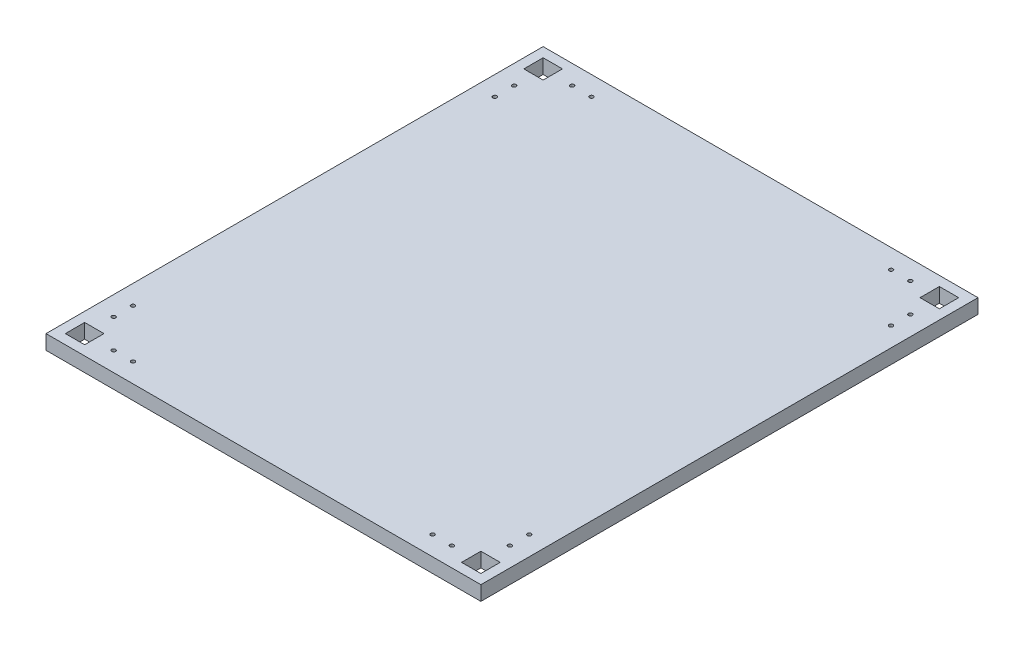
ISO-10303-21;
HEADER;
FILE_DESCRIPTION(('STEP AP214'),'2;1');
FILE_NAME('part.step','',(''),(''),'','','');
FILE_SCHEMA(('AUTOMOTIVE_DESIGN { 1 0 10303 214 1 1 1 1 }'));
ENDSEC;
DATA;
#1=APPLICATION_CONTEXT('core data for automotive mechanical design processes');
#2=APPLICATION_PROTOCOL_DEFINITION('international standard','automotive_design',2000,#1);
#3=PRODUCT_CONTEXT('',#1,'mechanical');
#4=PRODUCT('Part','Part','',(#3));
#5=PRODUCT_RELATED_PRODUCT_CATEGORY('part','',(#4));
#6=PRODUCT_DEFINITION_FORMATION('','',#4);
#7=PRODUCT_DEFINITION_CONTEXT('part definition',#1,'design');
#8=PRODUCT_DEFINITION('design','',#6,#7);
#9=PRODUCT_DEFINITION_SHAPE('','',#8);
#10=(LENGTH_UNIT() NAMED_UNIT(*) SI_UNIT(.MILLI.,.METRE.));
#11=(NAMED_UNIT(*) PLANE_ANGLE_UNIT() SI_UNIT($,.RADIAN.));
#12=(NAMED_UNIT(*) SI_UNIT($,.STERADIAN.) SOLID_ANGLE_UNIT());
#13=UNCERTAINTY_MEASURE_WITH_UNIT(LENGTH_MEASURE(1.E-05),#10,'distance_accuracy_value','');
#14=(GEOMETRIC_REPRESENTATION_CONTEXT(3) GLOBAL_UNCERTAINTY_ASSIGNED_CONTEXT((#13)) GLOBAL_UNIT_ASSIGNED_CONTEXT((#10,
#11,#12)) REPRESENTATION_CONTEXT('',''));
#15=CARTESIAN_POINT('',(0.,0.,0.));
#16=DIRECTION('',(0.,0.,1.));
#17=DIRECTION('',(1.,0.,0.));
#18=AXIS2_PLACEMENT_3D('',#15,#16,#17);
#19=CARTESIAN_POINT('',(225.,15.,257.2));
#20=DIRECTION('',(-1.,0.,0.));
#21=DIRECTION('',(0.,0.,1.));
#22=AXIS2_PLACEMENT_3D('',#19,#20,#21);
#23=PLANE('',#22);
#24=DIRECTION('',(0.,0.,-1.));
#25=VECTOR('',#24,1.);
#26=CARTESIAN_POINT('',(225.,0.,257.2));
#27=LINE('',#26,#25);
#28=CARTESIAN_POINT('',(225.,0.,257.2));
#29=VERTEX_POINT('',#28);
#30=CARTESIAN_POINT('',(225.,0.,-257.2));
#31=VERTEX_POINT('',#30);
#32=EDGE_CURVE('E299',#29,#31,#27,.T.);
#33=ORIENTED_EDGE('',*,*,#32,.T.);
#34=DIRECTION('',(0.,-1.,0.));
#35=VECTOR('',#34,1.);
#36=CARTESIAN_POINT('',(225.,15.,-257.2));
#37=LINE('',#36,#35);
#38=CARTESIAN_POINT('',(225.,15.,-257.2));
#39=VERTEX_POINT('',#38);
#40=EDGE_CURVE('E11',#39,#31,#37,.T.);
#41=ORIENTED_EDGE('',*,*,#40,.F.);
#42=DIRECTION('',(0.,0.,-1.));
#43=VECTOR('',#42,1.);
#44=CARTESIAN_POINT('',(225.,15.,257.2));
#45=LINE('',#44,#43);
#46=CARTESIAN_POINT('',(225.,15.,257.2));
#47=VERTEX_POINT('',#46);
#48=EDGE_CURVE('E306',#47,#39,#45,.T.);
#49=ORIENTED_EDGE('',*,*,#48,.F.);
#50=DIRECTION('',(0.,-1.,0.));
#51=VECTOR('',#50,1.);
#52=CARTESIAN_POINT('',(225.,15.,257.2));
#53=LINE('',#52,#51);
#54=EDGE_CURVE('E316',#47,#29,#53,.T.);
#55=ORIENTED_EDGE('',*,*,#54,.T.);
#56=EDGE_LOOP('',(#33,#41,#49,#55));
#57=FACE_BOUND('',#56,.T.);
#58=ADVANCED_FACE('F37',(#57),#23,.F.);
#59=CARTESIAN_POINT('',(-225.,15.,-257.2));
#60=DIRECTION('',(0.,0.,1.));
#61=DIRECTION('',(1.,0.,0.));
#62=AXIS2_PLACEMENT_3D('',#59,#60,#61);
#63=PLANE('',#62);
#64=DIRECTION('',(-1.,0.,0.));
#65=VECTOR('',#64,1.);
#66=CARTESIAN_POINT('',(-225.,0.,-257.2));
#67=LINE('',#66,#65);
#68=CARTESIAN_POINT('',(-225.,0.,-257.2));
#69=VERTEX_POINT('',#68);
#70=EDGE_CURVE('E319',#31,#69,#67,.T.);
#71=ORIENTED_EDGE('',*,*,#70,.T.);
#72=DIRECTION('',(0.,-1.,0.));
#73=VECTOR('',#72,1.);
#74=CARTESIAN_POINT('',(-225.,15.,-257.2));
#75=LINE('',#74,#73);
#76=CARTESIAN_POINT('',(-225.,15.,-257.2));
#77=VERTEX_POINT('',#76);
#78=EDGE_CURVE('E44',#77,#69,#75,.T.);
#79=ORIENTED_EDGE('',*,*,#78,.F.);
#80=DIRECTION('',(-1.,0.,0.));
#81=VECTOR('',#80,1.);
#82=CARTESIAN_POINT('',(-225.,15.,-257.2));
#83=LINE('',#82,#81);
#84=EDGE_CURVE('E309',#39,#77,#83,.T.);
#85=ORIENTED_EDGE('',*,*,#84,.F.);
#86=ORIENTED_EDGE('',*,*,#40,.T.);
#87=EDGE_LOOP('',(#71,#79,#85,#86));
#88=FACE_BOUND('',#87,.T.);
#89=ADVANCED_FACE('F348',(#88),#63,.F.);
#90=CARTESIAN_POINT('',(-225.,15.,257.2));
#91=DIRECTION('',(1.,0.,0.));
#92=DIRECTION('',(0.,0.,-1.));
#93=AXIS2_PLACEMENT_3D('',#90,#91,#92);
#94=PLANE('',#93);
#95=DIRECTION('',(0.,0.,1.));
#96=VECTOR('',#95,1.);
#97=CARTESIAN_POINT('',(-225.,0.,257.2));
#98=LINE('',#97,#96);
#99=CARTESIAN_POINT('',(-225.,0.,257.2));
#100=VERTEX_POINT('',#99);
#101=EDGE_CURVE('E321',#69,#100,#98,.T.);
#102=ORIENTED_EDGE('',*,*,#101,.T.);
#103=DIRECTION('',(0.,-1.,0.));
#104=VECTOR('',#103,1.);
#105=CARTESIAN_POINT('',(-225.,15.,257.2));
#106=LINE('',#105,#104);
#107=CARTESIAN_POINT('',(-225.,15.,257.2));
#108=VERTEX_POINT('',#107);
#109=EDGE_CURVE('E326',#108,#100,#106,.T.);
#110=ORIENTED_EDGE('',*,*,#109,.F.);
#111=DIRECTION('',(0.,0.,1.));
#112=VECTOR('',#111,1.);
#113=CARTESIAN_POINT('',(-225.,15.,257.2));
#114=LINE('',#113,#112);
#115=EDGE_CURVE('E312',#77,#108,#114,.T.);
#116=ORIENTED_EDGE('',*,*,#115,.F.);
#117=ORIENTED_EDGE('',*,*,#78,.T.);
#118=EDGE_LOOP('',(#102,#110,#116,#117));
#119=FACE_BOUND('',#118,.T.);
#120=ADVANCED_FACE('F333',(#119),#94,.F.);
#121=CARTESIAN_POINT('',(-225.,15.,257.2));
#122=DIRECTION('',(0.,0.,-1.));
#123=DIRECTION('',(-1.,0.,0.));
#124=AXIS2_PLACEMENT_3D('',#121,#122,#123);
#125=PLANE('',#124);
#126=DIRECTION('',(1.,0.,0.));
#127=VECTOR('',#126,1.);
#128=CARTESIAN_POINT('',(-225.,0.,257.2));
#129=LINE('',#128,#127);
#130=EDGE_CURVE('E310',#100,#29,#129,.T.);
#131=ORIENTED_EDGE('',*,*,#130,.T.);
#132=ORIENTED_EDGE('',*,*,#54,.F.);
#133=DIRECTION('',(1.,0.,0.));
#134=VECTOR('',#133,1.);
#135=CARTESIAN_POINT('',(-225.,15.,257.2));
#136=LINE('',#135,#134);
#137=EDGE_CURVE('E314',#108,#47,#136,.T.);
#138=ORIENTED_EDGE('',*,*,#137,.F.);
#139=ORIENTED_EDGE('',*,*,#109,.T.);
#140=EDGE_LOOP('',(#131,#132,#138,#139));
#141=FACE_BOUND('',#140,.T.);
#142=ADVANCED_FACE('F342',(#141),#125,.F.);
#143=CARTESIAN_POINT('',(0.,15.,0.));
#144=DIRECTION('',(0.,-1.,0.));
#145=DIRECTION('',(0.,0.,-1.));
#146=AXIS2_PLACEMENT_3D('',#143,#144,#145);
#147=PLANE('',#146);
#148=CARTESIAN_POINT('',(205.,15.,-207.2));
#149=DIRECTION('',(0.,1.,0.));
#150=DIRECTION('',(0.,0.,-1.));
#151=AXIS2_PLACEMENT_3D('',#148,#149,#150);
#152=CIRCLE('',#151,2.);
#153=CARTESIAN_POINT('',(205.,15.,-209.2));
#154=VERTEX_POINT('',#153);
#155=EDGE_CURVE('E547',#154,#154,#152,.T.);
#156=ORIENTED_EDGE('',*,*,#155,.F.);
#157=EDGE_LOOP('',(#156));
#158=FACE_BOUND('',#157,.T.);
#159=CARTESIAN_POINT('',(155.,15.,-237.2));
#160=DIRECTION('',(0.,1.,0.));
#161=DIRECTION('',(0.,0.,-1.));
#162=AXIS2_PLACEMENT_3D('',#159,#160,#161);
#163=CIRCLE('',#162,2.);
#164=CARTESIAN_POINT('',(155.,15.,-239.2));
#165=VERTEX_POINT('',#164);
#166=EDGE_CURVE('E554',#165,#165,#163,.T.);
#167=ORIENTED_EDGE('',*,*,#166,.F.);
#168=EDGE_LOOP('',(#167));
#169=FACE_BOUND('',#168,.T.);
#170=CARTESIAN_POINT('',(175.,15.,-237.2));
#171=DIRECTION('',(0.,1.,0.));
#172=DIRECTION('',(0.,0.,-1.));
#173=AXIS2_PLACEMENT_3D('',#170,#171,#172);
#174=CIRCLE('',#173,2.);
#175=CARTESIAN_POINT('',(175.,15.,-239.2));
#176=VERTEX_POINT('',#175);
#177=EDGE_CURVE('E535',#176,#176,#174,.T.);
#178=ORIENTED_EDGE('',*,*,#177,.F.);
#179=EDGE_LOOP('',(#178));
#180=FACE_BOUND('',#179,.T.);
#181=CARTESIAN_POINT('',(175.,15.,237.2));
#182=DIRECTION('',(0.,1.,0.));
#183=DIRECTION('',(0.,0.,1.));
#184=AXIS2_PLACEMENT_3D('',#181,#182,#183);
#185=CIRCLE('',#184,2.);
#186=CARTESIAN_POINT('',(175.,15.,239.2));
#187=VERTEX_POINT('',#186);
#188=EDGE_CURVE('E542',#187,#187,#185,.T.);
#189=ORIENTED_EDGE('',*,*,#188,.F.);
#190=EDGE_LOOP('',(#189));
#191=FACE_BOUND('',#190,.T.);
#192=CARTESIAN_POINT('',(205.,15.,-187.2));
#193=DIRECTION('',(0.,1.,0.));
#194=DIRECTION('',(0.,0.,-1.));
#195=AXIS2_PLACEMENT_3D('',#192,#193,#194);
#196=CIRCLE('',#195,2.);
#197=CARTESIAN_POINT('',(205.,15.,-189.2));
#198=VERTEX_POINT('',#197);
#199=EDGE_CURVE('E578',#198,#198,#196,.T.);
#200=ORIENTED_EDGE('',*,*,#199,.F.);
#201=EDGE_LOOP('',(#200));
#202=FACE_BOUND('',#201,.T.);
#203=CARTESIAN_POINT('',(-205.,15.,-187.2));
#204=DIRECTION('',(0.,1.,0.));
#205=DIRECTION('',(0.,0.,1.));
#206=AXIS2_PLACEMENT_3D('',#203,#204,#205);
#207=CIRCLE('',#206,2.);
#208=CARTESIAN_POINT('',(-205.,15.,-185.2));
#209=VERTEX_POINT('',#208);
#210=EDGE_CURVE('E572',#209,#209,#207,.T.);
#211=ORIENTED_EDGE('',*,*,#210,.F.);
#212=EDGE_LOOP('',(#211));
#213=FACE_BOUND('',#212,.T.);
#214=CARTESIAN_POINT('',(-205.,15.,-207.2));
#215=DIRECTION('',(0.,1.,0.));
#216=DIRECTION('',(0.,0.,1.));
#217=AXIS2_PLACEMENT_3D('',#214,#215,#216);
#218=CIRCLE('',#217,2.);
#219=CARTESIAN_POINT('',(-205.,15.,-205.2));
#220=VERTEX_POINT('',#219);
#221=EDGE_CURVE('E566',#220,#220,#218,.T.);
#222=ORIENTED_EDGE('',*,*,#221,.F.);
#223=EDGE_LOOP('',(#222));
#224=FACE_BOUND('',#223,.T.);
#225=CARTESIAN_POINT('',(-155.,15.,-237.2));
#226=DIRECTION('',(0.,1.,0.));
#227=DIRECTION('',(0.,0.,1.));
#228=AXIS2_PLACEMENT_3D('',#225,#226,#227);
#229=CIRCLE('',#228,2.);
#230=CARTESIAN_POINT('',(-155.,15.,-235.2));
#231=VERTEX_POINT('',#230);
#232=EDGE_CURVE('E559',#231,#231,#229,.T.);
#233=ORIENTED_EDGE('',*,*,#232,.F.);
#234=EDGE_LOOP('',(#233));
#235=FACE_BOUND('',#234,.T.);
#236=CARTESIAN_POINT('',(-205.,15.,207.2));
#237=DIRECTION('',(0.,1.,0.));
#238=DIRECTION('',(0.,0.,-1.));
#239=AXIS2_PLACEMENT_3D('',#236,#237,#238);
#240=CIRCLE('',#239,2.);
#241=CARTESIAN_POINT('',(-205.,15.,205.2));
#242=VERTEX_POINT('',#241);
#243=EDGE_CURVE('E502',#242,#242,#240,.T.);
#244=ORIENTED_EDGE('',*,*,#243,.F.);
#245=EDGE_LOOP('',(#244));
#246=FACE_BOUND('',#245,.T.);
#247=CARTESIAN_POINT('',(-155.,15.,237.2));
#248=DIRECTION('',(0.,1.,0.));
#249=DIRECTION('',(0.,0.,-1.));
#250=AXIS2_PLACEMENT_3D('',#247,#248,#249);
#251=CIRCLE('',#250,2.);
#252=CARTESIAN_POINT('',(-155.,15.,235.2));
#253=VERTEX_POINT('',#252);
#254=EDGE_CURVE('E498',#253,#253,#251,.T.);
#255=ORIENTED_EDGE('',*,*,#254,.F.);
#256=EDGE_LOOP('',(#255));
#257=FACE_BOUND('',#256,.T.);
#258=CARTESIAN_POINT('',(-175.,15.,237.2));
#259=DIRECTION('',(0.,1.,0.));
#260=DIRECTION('',(0.,0.,-1.));
#261=AXIS2_PLACEMENT_3D('',#258,#259,#260);
#262=CIRCLE('',#261,2.);
#263=CARTESIAN_POINT('',(-175.,15.,235.2));
#264=VERTEX_POINT('',#263);
#265=EDGE_CURVE('E493',#264,#264,#262,.T.);
#266=ORIENTED_EDGE('',*,*,#265,.F.);
#267=EDGE_LOOP('',(#266));
#268=FACE_BOUND('',#267,.T.);
#269=CARTESIAN_POINT('',(-205.,15.,187.2));
#270=DIRECTION('',(0.,1.,0.));
#271=DIRECTION('',(0.,0.,-1.));
#272=AXIS2_PLACEMENT_3D('',#269,#270,#271);
#273=CIRCLE('',#272,2.);
#274=CARTESIAN_POINT('',(-205.,15.,185.2));
#275=VERTEX_POINT('',#274);
#276=EDGE_CURVE('E530',#275,#275,#273,.T.);
#277=ORIENTED_EDGE('',*,*,#276,.F.);
#278=EDGE_LOOP('',(#277));
#279=FACE_BOUND('',#278,.T.);
#280=CARTESIAN_POINT('',(205.,15.,187.2));
#281=DIRECTION('',(0.,1.,0.));
#282=DIRECTION('',(0.,0.,1.));
#283=AXIS2_PLACEMENT_3D('',#280,#281,#282);
#284=CIRCLE('',#283,2.);
#285=CARTESIAN_POINT('',(205.,15.,189.2));
#286=VERTEX_POINT('',#285);
#287=EDGE_CURVE('E524',#286,#286,#284,.T.);
#288=ORIENTED_EDGE('',*,*,#287,.F.);
#289=EDGE_LOOP('',(#288));
#290=FACE_BOUND('',#289,.T.);
#291=CARTESIAN_POINT('',(205.,15.,207.2));
#292=DIRECTION('',(0.,1.,0.));
#293=DIRECTION('',(0.,0.,1.));
#294=AXIS2_PLACEMENT_3D('',#291,#292,#293);
#295=CIRCLE('',#294,2.);
#296=CARTESIAN_POINT('',(205.,15.,209.2));
#297=VERTEX_POINT('',#296);
#298=EDGE_CURVE('E518',#297,#297,#295,.T.);
#299=ORIENTED_EDGE('',*,*,#298,.F.);
#300=EDGE_LOOP('',(#299));
#301=FACE_BOUND('',#300,.T.);
#302=CARTESIAN_POINT('',(155.,15.,237.2));
#303=DIRECTION('',(0.,1.,0.));
#304=DIRECTION('',(0.,0.,1.));
#305=AXIS2_PLACEMENT_3D('',#302,#303,#304);
#306=CIRCLE('',#305,2.);
#307=CARTESIAN_POINT('',(155.,15.,239.2));
#308=VERTEX_POINT('',#307);
#309=EDGE_CURVE('E511',#308,#308,#306,.T.);
#310=ORIENTED_EDGE('',*,*,#309,.F.);
#311=EDGE_LOOP('',(#310));
#312=FACE_BOUND('',#311,.T.);
#313=CARTESIAN_POINT('',(-175.,15.,-237.2));
#314=DIRECTION('',(0.,1.,0.));
#315=DIRECTION('',(0.,0.,1.));
#316=AXIS2_PLACEMENT_3D('',#313,#314,#315);
#317=CIRCLE('',#316,2.);
#318=CARTESIAN_POINT('',(-175.,15.,-235.2));
#319=VERTEX_POINT('',#318);
#320=EDGE_CURVE('E562',#319,#319,#317,.T.);
#321=ORIENTED_EDGE('',*,*,#320,.F.);
#322=EDGE_LOOP('',(#321));
#323=FACE_BOUND('',#322,.T.);
#324=DIRECTION('',(-1.,0.,0.));
#325=VECTOR('',#324,1.);
#326=CARTESIAN_POINT('',(215.,15.,227.2));
#327=LINE('',#326,#325);
#328=CARTESIAN_POINT('',(215.,15.,227.2));
#329=VERTEX_POINT('',#328);
#330=CARTESIAN_POINT('',(195.,15.,227.2));
#331=VERTEX_POINT('',#330);
#332=EDGE_CURVE('E262',#329,#331,#327,.T.);
#333=ORIENTED_EDGE('',*,*,#332,.F.);
#334=DIRECTION('',(0.,0.,-1.));
#335=VECTOR('',#334,1.);
#336=CARTESIAN_POINT('',(215.,15.,247.2));
#337=LINE('',#336,#335);
#338=CARTESIAN_POINT('',(215.,15.,247.2));
#339=VERTEX_POINT('',#338);
#340=EDGE_CURVE('E51',#339,#329,#337,.T.);
#341=ORIENTED_EDGE('',*,*,#340,.F.);
#342=DIRECTION('',(1.,0.,0.));
#343=VECTOR('',#342,1.);
#344=CARTESIAN_POINT('',(215.,15.,247.2));
#345=LINE('',#344,#343);
#346=CARTESIAN_POINT('',(195.,15.,247.2));
#347=VERTEX_POINT('',#346);
#348=EDGE_CURVE('E255',#347,#339,#345,.T.);
#349=ORIENTED_EDGE('',*,*,#348,.F.);
#350=DIRECTION('',(0.,0.,1.));
#351=VECTOR('',#350,1.);
#352=CARTESIAN_POINT('',(195.,15.,247.2));
#353=LINE('',#352,#351);
#354=EDGE_CURVE('E258',#331,#347,#353,.T.);
#355=ORIENTED_EDGE('',*,*,#354,.F.);
#356=EDGE_LOOP('',(#333,#341,#349,#355));
#357=FACE_BOUND('',#356,.T.);
#358=DIRECTION('',(1.,0.,0.));
#359=VECTOR('',#358,1.);
#360=CARTESIAN_POINT('',(-215.,15.,247.2));
#361=LINE('',#360,#359);
#362=CARTESIAN_POINT('',(-215.,15.,247.2));
#363=VERTEX_POINT('',#362);
#364=CARTESIAN_POINT('',(-195.,15.,247.2));
#365=VERTEX_POINT('',#364);
#366=EDGE_CURVE('E231',#363,#365,#361,.T.);
#367=ORIENTED_EDGE('',*,*,#366,.F.);
#368=DIRECTION('',(0.,0.,1.));
#369=VECTOR('',#368,1.);
#370=CARTESIAN_POINT('',(-215.,15.,247.2));
#371=LINE('',#370,#369);
#372=CARTESIAN_POINT('',(-215.,15.,227.2));
#373=VERTEX_POINT('',#372);
#374=EDGE_CURVE('E59',#373,#363,#371,.T.);
#375=ORIENTED_EDGE('',*,*,#374,.F.);
#376=DIRECTION('',(-1.,0.,0.));
#377=VECTOR('',#376,1.);
#378=CARTESIAN_POINT('',(-215.,15.,227.2));
#379=LINE('',#378,#377);
#380=CARTESIAN_POINT('',(-195.,15.,227.2));
#381=VERTEX_POINT('',#380);
#382=EDGE_CURVE('E224',#381,#373,#379,.T.);
#383=ORIENTED_EDGE('',*,*,#382,.F.);
#384=DIRECTION('',(0.,0.,-1.));
#385=VECTOR('',#384,1.);
#386=CARTESIAN_POINT('',(-195.,15.,247.2));
#387=LINE('',#386,#385);
#388=EDGE_CURVE('E227',#365,#381,#387,.T.);
#389=ORIENTED_EDGE('',*,*,#388,.F.);
#390=EDGE_LOOP('',(#367,#375,#383,#389));
#391=FACE_BOUND('',#390,.T.);
#392=DIRECTION('',(1.,0.,0.));
#393=VECTOR('',#392,1.);
#394=CARTESIAN_POINT('',(-215.,15.,-227.2));
#395=LINE('',#394,#393);
#396=CARTESIAN_POINT('',(-215.,15.,-227.2));
#397=VERTEX_POINT('',#396);
#398=CARTESIAN_POINT('',(-195.,15.,-227.2));
#399=VERTEX_POINT('',#398);
#400=EDGE_CURVE('E197',#397,#399,#395,.T.);
#401=ORIENTED_EDGE('',*,*,#400,.F.);
#402=DIRECTION('',(0.,0.,1.));
#403=VECTOR('',#402,1.);
#404=CARTESIAN_POINT('',(-215.,15.,-247.2));
#405=LINE('',#404,#403);
#406=CARTESIAN_POINT('',(-215.,15.,-247.2));
#407=VERTEX_POINT('',#406);
#408=EDGE_CURVE('E176',#407,#397,#405,.T.);
#409=ORIENTED_EDGE('',*,*,#408,.F.);
#410=DIRECTION('',(-1.,0.,0.));
#411=VECTOR('',#410,1.);
#412=CARTESIAN_POINT('',(-215.,15.,-247.2));
#413=LINE('',#412,#411);
#414=CARTESIAN_POINT('',(-195.,15.,-247.2));
#415=VERTEX_POINT('',#414);
#416=EDGE_CURVE('E186',#415,#407,#413,.T.);
#417=ORIENTED_EDGE('',*,*,#416,.F.);
#418=DIRECTION('',(0.,0.,-1.));
#419=VECTOR('',#418,1.);
#420=CARTESIAN_POINT('',(-195.,15.,-247.2));
#421=LINE('',#420,#419);
#422=EDGE_CURVE('E191',#399,#415,#421,.T.);
#423=ORIENTED_EDGE('',*,*,#422,.F.);
#424=EDGE_LOOP('',(#401,#409,#417,#423));
#425=FACE_BOUND('',#424,.T.);
#426=DIRECTION('',(1.,0.,0.));
#427=VECTOR('',#426,1.);
#428=CARTESIAN_POINT('',(215.,15.,-227.2));
#429=LINE('',#428,#427);
#430=CARTESIAN_POINT('',(195.,15.,-227.2));
#431=VERTEX_POINT('',#430);
#432=CARTESIAN_POINT('',(215.,15.,-227.2));
#433=VERTEX_POINT('',#432);
#434=EDGE_CURVE('E200',#431,#433,#429,.T.);
#435=ORIENTED_EDGE('',*,*,#434,.F.);
#436=DIRECTION('',(0.,0.,1.));
#437=VECTOR('',#436,1.);
#438=CARTESIAN_POINT('',(195.,15.,-247.2));
#439=LINE('',#438,#437);
#440=CARTESIAN_POINT('',(195.,15.,-247.2));
#441=VERTEX_POINT('',#440);
#442=EDGE_CURVE('E198',#441,#431,#439,.T.);
#443=ORIENTED_EDGE('',*,*,#442,.F.);
#444=DIRECTION('',(-1.,0.,0.));
#445=VECTOR('',#444,1.);
#446=CARTESIAN_POINT('',(215.,15.,-247.2));
#447=LINE('',#446,#445);
#448=CARTESIAN_POINT('',(215.,15.,-247.2));
#449=VERTEX_POINT('',#448);
#450=EDGE_CURVE('E280',#449,#441,#447,.T.);
#451=ORIENTED_EDGE('',*,*,#450,.F.);
#452=DIRECTION('',(0.,0.,-1.));
#453=VECTOR('',#452,1.);
#454=CARTESIAN_POINT('',(215.,15.,-247.2));
#455=LINE('',#454,#453);
#456=EDGE_CURVE('E292',#433,#449,#455,.T.);
#457=ORIENTED_EDGE('',*,*,#456,.F.);
#458=EDGE_LOOP('',(#435,#443,#451,#457));
#459=FACE_BOUND('',#458,.T.);
#460=ORIENTED_EDGE('',*,*,#48,.T.);
#461=ORIENTED_EDGE('',*,*,#84,.T.);
#462=ORIENTED_EDGE('',*,*,#115,.T.);
#463=ORIENTED_EDGE('',*,*,#137,.T.);
#464=EDGE_LOOP('',(#460,#461,#462,#463));
#465=FACE_BOUND('',#464,.T.);
#466=ADVANCED_FACE('F194',(#158,#169,#180,#191,#202,#213,#224,#235,#246,#257,#268,#279,#290,
#301,#312,#323,#357,#391,#425,#459,#465),#147,.F.);
#467=CARTESIAN_POINT('',(0.,0.,0.));
#468=DIRECTION('',(0.,-1.,0.));
#469=DIRECTION('',(0.,0.,-1.));
#470=AXIS2_PLACEMENT_3D('',#467,#468,#469);
#471=PLANE('',#470);
#472=CARTESIAN_POINT('',(205.,0.,-207.2));
#473=DIRECTION('',(0.,1.,0.));
#474=DIRECTION('',(0.,0.,-1.));
#475=AXIS2_PLACEMENT_3D('',#472,#473,#474);
#476=CIRCLE('',#475,2.);
#477=CARTESIAN_POINT('',(205.,0.,-209.2));
#478=VERTEX_POINT('',#477);
#479=EDGE_CURVE('E551',#478,#478,#476,.T.);
#480=ORIENTED_EDGE('',*,*,#479,.T.);
#481=EDGE_LOOP('',(#480));
#482=FACE_BOUND('',#481,.T.);
#483=CARTESIAN_POINT('',(155.,0.,-237.2));
#484=DIRECTION('',(0.,1.,0.));
#485=DIRECTION('',(0.,0.,-1.));
#486=AXIS2_PLACEMENT_3D('',#483,#484,#485);
#487=CIRCLE('',#486,2.);
#488=CARTESIAN_POINT('',(155.,0.,-239.2));
#489=VERTEX_POINT('',#488);
#490=EDGE_CURVE('E538',#489,#489,#487,.T.);
#491=ORIENTED_EDGE('',*,*,#490,.T.);
#492=EDGE_LOOP('',(#491));
#493=FACE_BOUND('',#492,.T.);
#494=CARTESIAN_POINT('',(175.,0.,-237.2));
#495=DIRECTION('',(0.,1.,0.));
#496=DIRECTION('',(0.,0.,-1.));
#497=AXIS2_PLACEMENT_3D('',#494,#495,#496);
#498=CIRCLE('',#497,2.);
#499=CARTESIAN_POINT('',(175.,0.,-239.2));
#500=VERTEX_POINT('',#499);
#501=EDGE_CURVE('E539',#500,#500,#498,.T.);
#502=ORIENTED_EDGE('',*,*,#501,.T.);
#503=EDGE_LOOP('',(#502));
#504=FACE_BOUND('',#503,.T.);
#505=CARTESIAN_POINT('',(175.,0.,237.2));
#506=DIRECTION('',(0.,1.,0.));
#507=DIRECTION('',(0.,0.,1.));
#508=AXIS2_PLACEMENT_3D('',#505,#506,#507);
#509=CIRCLE('',#508,2.);
#510=CARTESIAN_POINT('',(175.,0.,239.2));
#511=VERTEX_POINT('',#510);
#512=EDGE_CURVE('E514',#511,#511,#509,.T.);
#513=ORIENTED_EDGE('',*,*,#512,.T.);
#514=EDGE_LOOP('',(#513));
#515=FACE_BOUND('',#514,.T.);
#516=CARTESIAN_POINT('',(205.,0.,-187.2));
#517=DIRECTION('',(0.,1.,0.));
#518=DIRECTION('',(0.,0.,-1.));
#519=AXIS2_PLACEMENT_3D('',#516,#517,#518);
#520=CIRCLE('',#519,2.);
#521=CARTESIAN_POINT('',(205.,0.,-189.2));
#522=VERTEX_POINT('',#521);
#523=EDGE_CURVE('E550',#522,#522,#520,.T.);
#524=ORIENTED_EDGE('',*,*,#523,.T.);
#525=EDGE_LOOP('',(#524));
#526=FACE_BOUND('',#525,.T.);
#527=CARTESIAN_POINT('',(-205.,0.,-187.2));
#528=DIRECTION('',(0.,1.,0.));
#529=DIRECTION('',(0.,0.,1.));
#530=AXIS2_PLACEMENT_3D('',#527,#528,#529);
#531=CIRCLE('',#530,2.);
#532=CARTESIAN_POINT('',(-205.,0.,-185.2));
#533=VERTEX_POINT('',#532);
#534=EDGE_CURVE('E575',#533,#533,#531,.T.);
#535=ORIENTED_EDGE('',*,*,#534,.T.);
#536=EDGE_LOOP('',(#535));
#537=FACE_BOUND('',#536,.T.);
#538=CARTESIAN_POINT('',(-205.,0.,-207.2));
#539=DIRECTION('',(0.,1.,0.));
#540=DIRECTION('',(0.,0.,1.));
#541=AXIS2_PLACEMENT_3D('',#538,#539,#540);
#542=CIRCLE('',#541,2.);
#543=CARTESIAN_POINT('',(-205.,0.,-205.2));
#544=VERTEX_POINT('',#543);
#545=EDGE_CURVE('E569',#544,#544,#542,.T.);
#546=ORIENTED_EDGE('',*,*,#545,.T.);
#547=EDGE_LOOP('',(#546));
#548=FACE_BOUND('',#547,.T.);
#549=CARTESIAN_POINT('',(-155.,0.,-237.2));
#550=DIRECTION('',(0.,1.,0.));
#551=DIRECTION('',(0.,0.,1.));
#552=AXIS2_PLACEMENT_3D('',#549,#550,#551);
#553=CIRCLE('',#552,2.);
#554=CARTESIAN_POINT('',(-155.,0.,-235.2));
#555=VERTEX_POINT('',#554);
#556=EDGE_CURVE('E563',#555,#555,#553,.T.);
#557=ORIENTED_EDGE('',*,*,#556,.T.);
#558=EDGE_LOOP('',(#557));
#559=FACE_BOUND('',#558,.T.);
#560=CARTESIAN_POINT('',(-205.,0.,207.2));
#561=DIRECTION('',(0.,1.,0.));
#562=DIRECTION('',(0.,0.,-1.));
#563=AXIS2_PLACEMENT_3D('',#560,#561,#562);
#564=CIRCLE('',#563,2.);
#565=CARTESIAN_POINT('',(-205.,0.,205.2));
#566=VERTEX_POINT('',#565);
#567=EDGE_CURVE('E506',#566,#566,#564,.T.);
#568=ORIENTED_EDGE('',*,*,#567,.T.);
#569=EDGE_LOOP('',(#568));
#570=FACE_BOUND('',#569,.T.);
#571=CARTESIAN_POINT('',(-155.,0.,237.2));
#572=DIRECTION('',(0.,1.,0.));
#573=DIRECTION('',(0.,0.,-1.));
#574=AXIS2_PLACEMENT_3D('',#571,#572,#573);
#575=CIRCLE('',#574,2.);
#576=CARTESIAN_POINT('',(-155.,0.,235.2));
#577=VERTEX_POINT('',#576);
#578=EDGE_CURVE('E495',#577,#577,#575,.T.);
#579=ORIENTED_EDGE('',*,*,#578,.T.);
#580=EDGE_LOOP('',(#579));
#581=FACE_BOUND('',#580,.T.);
#582=CARTESIAN_POINT('',(-175.,0.,237.2));
#583=DIRECTION('',(0.,1.,0.));
#584=DIRECTION('',(0.,0.,-1.));
#585=AXIS2_PLACEMENT_3D('',#582,#583,#584);
#586=CIRCLE('',#585,2.);
#587=CARTESIAN_POINT('',(-175.,0.,235.2));
#588=VERTEX_POINT('',#587);
#589=EDGE_CURVE('E490',#588,#588,#586,.T.);
#590=ORIENTED_EDGE('',*,*,#589,.T.);
#591=EDGE_LOOP('',(#590));
#592=FACE_BOUND('',#591,.T.);
#593=CARTESIAN_POINT('',(-205.,0.,187.2));
#594=DIRECTION('',(0.,1.,0.));
#595=DIRECTION('',(0.,0.,-1.));
#596=AXIS2_PLACEMENT_3D('',#593,#594,#595);
#597=CIRCLE('',#596,2.);
#598=CARTESIAN_POINT('',(-205.,0.,185.2));
#599=VERTEX_POINT('',#598);
#600=EDGE_CURVE('E505',#599,#599,#597,.T.);
#601=ORIENTED_EDGE('',*,*,#600,.T.);
#602=EDGE_LOOP('',(#601));
#603=FACE_BOUND('',#602,.T.);
#604=CARTESIAN_POINT('',(205.,0.,187.2));
#605=DIRECTION('',(0.,1.,0.));
#606=DIRECTION('',(0.,0.,1.));
#607=AXIS2_PLACEMENT_3D('',#604,#605,#606);
#608=CIRCLE('',#607,2.);
#609=CARTESIAN_POINT('',(205.,0.,189.2));
#610=VERTEX_POINT('',#609);
#611=EDGE_CURVE('E527',#610,#610,#608,.T.);
#612=ORIENTED_EDGE('',*,*,#611,.T.);
#613=EDGE_LOOP('',(#612));
#614=FACE_BOUND('',#613,.T.);
#615=CARTESIAN_POINT('',(205.,0.,207.2));
#616=DIRECTION('',(0.,1.,0.));
#617=DIRECTION('',(0.,0.,1.));
#618=AXIS2_PLACEMENT_3D('',#615,#616,#617);
#619=CIRCLE('',#618,2.);
#620=CARTESIAN_POINT('',(205.,0.,209.2));
#621=VERTEX_POINT('',#620);
#622=EDGE_CURVE('E521',#621,#621,#619,.T.);
#623=ORIENTED_EDGE('',*,*,#622,.T.);
#624=EDGE_LOOP('',(#623));
#625=FACE_BOUND('',#624,.T.);
#626=CARTESIAN_POINT('',(155.,0.,237.2));
#627=DIRECTION('',(0.,1.,0.));
#628=DIRECTION('',(0.,0.,1.));
#629=AXIS2_PLACEMENT_3D('',#626,#627,#628);
#630=CIRCLE('',#629,2.);
#631=CARTESIAN_POINT('',(155.,0.,239.2));
#632=VERTEX_POINT('',#631);
#633=EDGE_CURVE('E515',#632,#632,#630,.T.);
#634=ORIENTED_EDGE('',*,*,#633,.T.);
#635=EDGE_LOOP('',(#634));
#636=FACE_BOUND('',#635,.T.);
#637=CARTESIAN_POINT('',(-175.,0.,-237.2));
#638=DIRECTION('',(0.,1.,0.));
#639=DIRECTION('',(0.,0.,1.));
#640=AXIS2_PLACEMENT_3D('',#637,#638,#639);
#641=CIRCLE('',#640,2.);
#642=CARTESIAN_POINT('',(-175.,0.,-235.2));
#643=VERTEX_POINT('',#642);
#644=EDGE_CURVE('E254',#643,#643,#641,.T.);
#645=ORIENTED_EDGE('',*,*,#644,.T.);
#646=EDGE_LOOP('',(#645));
#647=FACE_BOUND('',#646,.T.);
#648=DIRECTION('',(0.,0.,-1.));
#649=VECTOR('',#648,1.);
#650=CARTESIAN_POINT('',(215.,0.,247.2));
#651=LINE('',#650,#649);
#652=CARTESIAN_POINT('',(215.,0.,247.2));
#653=VERTEX_POINT('',#652);
#654=CARTESIAN_POINT('',(215.,0.,227.2));
#655=VERTEX_POINT('',#654);
#656=EDGE_CURVE('E259',#653,#655,#651,.T.);
#657=ORIENTED_EDGE('',*,*,#656,.T.);
#658=DIRECTION('',(-1.,0.,0.));
#659=VECTOR('',#658,1.);
#660=CARTESIAN_POINT('',(215.,0.,227.2));
#661=LINE('',#660,#659);
#662=CARTESIAN_POINT('',(195.,0.,227.2));
#663=VERTEX_POINT('',#662);
#664=EDGE_CURVE('E271',#655,#663,#661,.T.);
#665=ORIENTED_EDGE('',*,*,#664,.T.);
#666=DIRECTION('',(0.,0.,1.));
#667=VECTOR('',#666,1.);
#668=CARTESIAN_POINT('',(195.,0.,247.2));
#669=LINE('',#668,#667);
#670=CARTESIAN_POINT('',(195.,0.,247.2));
#671=VERTEX_POINT('',#670);
#672=EDGE_CURVE('E268',#663,#671,#669,.T.);
#673=ORIENTED_EDGE('',*,*,#672,.T.);
#674=DIRECTION('',(1.,0.,0.));
#675=VECTOR('',#674,1.);
#676=CARTESIAN_POINT('',(215.,0.,247.2));
#677=LINE('',#676,#675);
#678=EDGE_CURVE('E247',#671,#653,#677,.T.);
#679=ORIENTED_EDGE('',*,*,#678,.T.);
#680=EDGE_LOOP('',(#657,#665,#673,#679));
#681=FACE_BOUND('',#680,.T.);
#682=DIRECTION('',(0.,0.,1.));
#683=VECTOR('',#682,1.);
#684=CARTESIAN_POINT('',(-215.,0.,247.2));
#685=LINE('',#684,#683);
#686=CARTESIAN_POINT('',(-215.,0.,227.2));
#687=VERTEX_POINT('',#686);
#688=CARTESIAN_POINT('',(-215.,0.,247.2));
#689=VERTEX_POINT('',#688);
#690=EDGE_CURVE('E228',#687,#689,#685,.T.);
#691=ORIENTED_EDGE('',*,*,#690,.T.);
#692=DIRECTION('',(1.,0.,0.));
#693=VECTOR('',#692,1.);
#694=CARTESIAN_POINT('',(-215.,0.,247.2));
#695=LINE('',#694,#693);
#696=CARTESIAN_POINT('',(-195.,0.,247.2));
#697=VERTEX_POINT('',#696);
#698=EDGE_CURVE('E240',#689,#697,#695,.T.);
#699=ORIENTED_EDGE('',*,*,#698,.T.);
#700=DIRECTION('',(0.,0.,-1.));
#701=VECTOR('',#700,1.);
#702=CARTESIAN_POINT('',(-195.,0.,247.2));
#703=LINE('',#702,#701);
#704=CARTESIAN_POINT('',(-195.,0.,227.2));
#705=VERTEX_POINT('',#704);
#706=EDGE_CURVE('E237',#697,#705,#703,.T.);
#707=ORIENTED_EDGE('',*,*,#706,.T.);
#708=DIRECTION('',(-1.,0.,0.));
#709=VECTOR('',#708,1.);
#710=CARTESIAN_POINT('',(-215.,0.,227.2));
#711=LINE('',#710,#709);
#712=EDGE_CURVE('E217',#705,#687,#711,.T.);
#713=ORIENTED_EDGE('',*,*,#712,.T.);
#714=EDGE_LOOP('',(#691,#699,#707,#713));
#715=FACE_BOUND('',#714,.T.);
#716=DIRECTION('',(0.,0.,1.));
#717=VECTOR('',#716,1.);
#718=CARTESIAN_POINT('',(-215.,0.,-247.2));
#719=LINE('',#718,#717);
#720=CARTESIAN_POINT('',(-215.,0.,-247.2));
#721=VERTEX_POINT('',#720);
#722=CARTESIAN_POINT('',(-215.,0.,-227.2));
#723=VERTEX_POINT('',#722);
#724=EDGE_CURVE('E179',#721,#723,#719,.T.);
#725=ORIENTED_EDGE('',*,*,#724,.T.);
#726=DIRECTION('',(1.,0.,0.));
#727=VECTOR('',#726,1.);
#728=CARTESIAN_POINT('',(-215.,0.,-227.2));
#729=LINE('',#728,#727);
#730=CARTESIAN_POINT('',(-195.,0.,-227.2));
#731=VERTEX_POINT('',#730);
#732=EDGE_CURVE('E211',#723,#731,#729,.T.);
#733=ORIENTED_EDGE('',*,*,#732,.T.);
#734=DIRECTION('',(0.,0.,-1.));
#735=VECTOR('',#734,1.);
#736=CARTESIAN_POINT('',(-195.,0.,-247.2));
#737=LINE('',#736,#735);
#738=CARTESIAN_POINT('',(-195.,0.,-247.2));
#739=VERTEX_POINT('',#738);
#740=EDGE_CURVE('E207',#731,#739,#737,.T.);
#741=ORIENTED_EDGE('',*,*,#740,.T.);
#742=DIRECTION('',(-1.,0.,0.));
#743=VECTOR('',#742,1.);
#744=CARTESIAN_POINT('',(-215.,0.,-247.2));
#745=LINE('',#744,#743);
#746=EDGE_CURVE('E205',#739,#721,#745,.T.);
#747=ORIENTED_EDGE('',*,*,#746,.T.);
#748=EDGE_LOOP('',(#725,#733,#741,#747));
#749=FACE_BOUND('',#748,.T.);
#750=DIRECTION('',(0.,0.,1.));
#751=VECTOR('',#750,1.);
#752=CARTESIAN_POINT('',(195.,0.,-247.2));
#753=LINE('',#752,#751);
#754=CARTESIAN_POINT('',(195.,0.,-247.2));
#755=VERTEX_POINT('',#754);
#756=CARTESIAN_POINT('',(195.,0.,-227.2));
#757=VERTEX_POINT('',#756);
#758=EDGE_CURVE('E276',#755,#757,#753,.T.);
#759=ORIENTED_EDGE('',*,*,#758,.T.);
#760=DIRECTION('',(1.,0.,0.));
#761=VECTOR('',#760,1.);
#762=CARTESIAN_POINT('',(215.,0.,-227.2));
#763=LINE('',#762,#761);
#764=CARTESIAN_POINT('',(215.,0.,-227.2));
#765=VERTEX_POINT('',#764);
#766=EDGE_CURVE('E279',#757,#765,#763,.T.);
#767=ORIENTED_EDGE('',*,*,#766,.T.);
#768=DIRECTION('',(0.,0.,-1.));
#769=VECTOR('',#768,1.);
#770=CARTESIAN_POINT('',(215.,0.,-247.2));
#771=LINE('',#770,#769);
#772=CARTESIAN_POINT('',(215.,0.,-247.2));
#773=VERTEX_POINT('',#772);
#774=EDGE_CURVE('E283',#765,#773,#771,.T.);
#775=ORIENTED_EDGE('',*,*,#774,.T.);
#776=DIRECTION('',(-1.,0.,0.));
#777=VECTOR('',#776,1.);
#778=CARTESIAN_POINT('',(215.,0.,-247.2));
#779=LINE('',#778,#777);
#780=EDGE_CURVE('E286',#773,#755,#779,.T.);
#781=ORIENTED_EDGE('',*,*,#780,.T.);
#782=EDGE_LOOP('',(#759,#767,#775,#781));
#783=FACE_BOUND('',#782,.T.);
#784=ORIENTED_EDGE('',*,*,#32,.F.);
#785=ORIENTED_EDGE('',*,*,#130,.F.);
#786=ORIENTED_EDGE('',*,*,#101,.F.);
#787=ORIENTED_EDGE('',*,*,#70,.F.);
#788=EDGE_LOOP('',(#784,#785,#786,#787));
#789=FACE_BOUND('',#788,.T.);
#790=ADVANCED_FACE('F339',(#482,#493,#504,#515,#526,#537,#548,#559,#570,#581,#592,#603,#614,
#625,#636,#647,#681,#715,#749,#783,#789),#471,.T.);
#791=CARTESIAN_POINT('',(195.,0.,-247.2));
#792=DIRECTION('',(-1.,0.,0.));
#793=DIRECTION('',(0.,0.,1.));
#794=AXIS2_PLACEMENT_3D('',#791,#792,#793);
#795=PLANE('',#794);
#796=ORIENTED_EDGE('',*,*,#442,.T.);
#797=DIRECTION('',(0.,1.,0.));
#798=VECTOR('',#797,1.);
#799=CARTESIAN_POINT('',(195.,0.,-227.2));
#800=LINE('',#799,#798);
#801=EDGE_CURVE('E288',#757,#431,#800,.T.);
#802=ORIENTED_EDGE('',*,*,#801,.F.);
#803=ORIENTED_EDGE('',*,*,#758,.F.);
#804=DIRECTION('',(0.,1.,0.));
#805=VECTOR('',#804,1.);
#806=CARTESIAN_POINT('',(195.,0.,-247.2));
#807=LINE('',#806,#805);
#808=EDGE_CURVE('E297',#755,#441,#807,.T.);
#809=ORIENTED_EDGE('',*,*,#808,.T.);
#810=EDGE_LOOP('',(#796,#802,#803,#809));
#811=FACE_BOUND('',#810,.T.);
#812=ADVANCED_FACE('F360',(#811),#795,.F.);
#813=CARTESIAN_POINT('',(215.,0.,-247.2));
#814=DIRECTION('',(0.,0.,-1.));
#815=DIRECTION('',(-1.,0.,0.));
#816=AXIS2_PLACEMENT_3D('',#813,#814,#815);
#817=PLANE('',#816);
#818=ORIENTED_EDGE('',*,*,#450,.T.);
#819=ORIENTED_EDGE('',*,*,#808,.F.);
#820=ORIENTED_EDGE('',*,*,#780,.F.);
#821=DIRECTION('',(0.,1.,0.));
#822=VECTOR('',#821,1.);
#823=CARTESIAN_POINT('',(215.,0.,-247.2));
#824=LINE('',#823,#822);
#825=EDGE_CURVE('E300',#773,#449,#824,.T.);
#826=ORIENTED_EDGE('',*,*,#825,.T.);
#827=EDGE_LOOP('',(#818,#819,#820,#826));
#828=FACE_BOUND('',#827,.T.);
#829=ADVANCED_FACE('F367',(#828),#817,.F.);
#830=CARTESIAN_POINT('',(215.,0.,-247.2));
#831=DIRECTION('',(1.,0.,0.));
#832=DIRECTION('',(0.,0.,-1.));
#833=AXIS2_PLACEMENT_3D('',#830,#831,#832);
#834=PLANE('',#833);
#835=ORIENTED_EDGE('',*,*,#456,.T.);
#836=ORIENTED_EDGE('',*,*,#825,.F.);
#837=ORIENTED_EDGE('',*,*,#774,.F.);
#838=DIRECTION('',(0.,1.,0.));
#839=VECTOR('',#838,1.);
#840=CARTESIAN_POINT('',(215.,0.,-227.2));
#841=LINE('',#840,#839);
#842=EDGE_CURVE('E302',#765,#433,#841,.T.);
#843=ORIENTED_EDGE('',*,*,#842,.T.);
#844=EDGE_LOOP('',(#835,#836,#837,#843));
#845=FACE_BOUND('',#844,.T.);
#846=ADVANCED_FACE('F372',(#845),#834,.F.);
#847=CARTESIAN_POINT('',(215.,0.,-227.2));
#848=DIRECTION('',(0.,0.,1.));
#849=DIRECTION('',(1.,0.,0.));
#850=AXIS2_PLACEMENT_3D('',#847,#848,#849);
#851=PLANE('',#850);
#852=ORIENTED_EDGE('',*,*,#434,.T.);
#853=ORIENTED_EDGE('',*,*,#842,.F.);
#854=ORIENTED_EDGE('',*,*,#766,.F.);
#855=ORIENTED_EDGE('',*,*,#801,.T.);
#856=EDGE_LOOP('',(#852,#853,#854,#855));
#857=FACE_BOUND('',#856,.T.);
#858=ADVANCED_FACE('F369',(#857),#851,.F.);
#859=CARTESIAN_POINT('',(-215.,0.,-247.2));
#860=DIRECTION('',(-1.,0.,0.));
#861=DIRECTION('',(0.,0.,1.));
#862=AXIS2_PLACEMENT_3D('',#859,#860,#861);
#863=PLANE('',#862);
#864=ORIENTED_EDGE('',*,*,#408,.T.);
#865=DIRECTION('',(0.,1.,0.));
#866=VECTOR('',#865,1.);
#867=CARTESIAN_POINT('',(-215.,0.,-227.2));
#868=LINE('',#867,#866);
#869=EDGE_CURVE('E208',#723,#397,#868,.T.);
#870=ORIENTED_EDGE('',*,*,#869,.F.);
#871=ORIENTED_EDGE('',*,*,#724,.F.);
#872=DIRECTION('',(0.,1.,0.));
#873=VECTOR('',#872,1.);
#874=CARTESIAN_POINT('',(-215.,0.,-247.2));
#875=LINE('',#874,#873);
#876=EDGE_CURVE('E172',#721,#407,#875,.T.);
#877=ORIENTED_EDGE('',*,*,#876,.T.);
#878=EDGE_LOOP('',(#864,#870,#871,#877));
#879=FACE_BOUND('',#878,.T.);
#880=ADVANCED_FACE('F174',(#879),#863,.F.);
#881=CARTESIAN_POINT('',(-215.,0.,-247.2));
#882=DIRECTION('',(0.,0.,-1.));
#883=DIRECTION('',(-1.,0.,0.));
#884=AXIS2_PLACEMENT_3D('',#881,#882,#883);
#885=PLANE('',#884);
#886=ORIENTED_EDGE('',*,*,#416,.T.);
#887=ORIENTED_EDGE('',*,*,#876,.F.);
#888=ORIENTED_EDGE('',*,*,#746,.F.);
#889=DIRECTION('',(0.,1.,0.));
#890=VECTOR('',#889,1.);
#891=CARTESIAN_POINT('',(-195.,0.,-247.2));
#892=LINE('',#891,#890);
#893=EDGE_CURVE('E183',#739,#415,#892,.T.);
#894=ORIENTED_EDGE('',*,*,#893,.T.);
#895=EDGE_LOOP('',(#886,#887,#888,#894));
#896=FACE_BOUND('',#895,.T.);
#897=ADVANCED_FACE('F187',(#896),#885,.F.);
#898=CARTESIAN_POINT('',(-195.,0.,-247.2));
#899=DIRECTION('',(1.,0.,0.));
#900=DIRECTION('',(0.,0.,-1.));
#901=AXIS2_PLACEMENT_3D('',#898,#899,#900);
#902=PLANE('',#901);
#903=ORIENTED_EDGE('',*,*,#422,.T.);
#904=ORIENTED_EDGE('',*,*,#893,.F.);
#905=ORIENTED_EDGE('',*,*,#740,.F.);
#906=DIRECTION('',(0.,1.,0.));
#907=VECTOR('',#906,1.);
#908=CARTESIAN_POINT('',(-195.,0.,-227.2));
#909=LINE('',#908,#907);
#910=EDGE_CURVE('E588',#731,#399,#909,.T.);
#911=ORIENTED_EDGE('',*,*,#910,.T.);
#912=EDGE_LOOP('',(#903,#904,#905,#911));
#913=FACE_BOUND('',#912,.T.);
#914=ADVANCED_FACE('F414',(#913),#902,.F.);
#915=CARTESIAN_POINT('',(-215.,0.,-227.2));
#916=DIRECTION('',(0.,0.,1.));
#917=DIRECTION('',(1.,0.,0.));
#918=AXIS2_PLACEMENT_3D('',#915,#916,#917);
#919=PLANE('',#918);
#920=ORIENTED_EDGE('',*,*,#400,.T.);
#921=ORIENTED_EDGE('',*,*,#910,.F.);
#922=ORIENTED_EDGE('',*,*,#732,.F.);
#923=ORIENTED_EDGE('',*,*,#869,.T.);
#924=EDGE_LOOP('',(#920,#921,#922,#923));
#925=FACE_BOUND('',#924,.T.);
#926=ADVANCED_FACE('F411',(#925),#919,.F.);
#927=CARTESIAN_POINT('',(-215.,0.,247.2));
#928=DIRECTION('',(-1.,0.,0.));
#929=DIRECTION('',(0.,0.,1.));
#930=AXIS2_PLACEMENT_3D('',#927,#928,#929);
#931=PLANE('',#930);
#932=ORIENTED_EDGE('',*,*,#374,.T.);
#933=DIRECTION('',(0.,1.,0.));
#934=VECTOR('',#933,1.);
#935=CARTESIAN_POINT('',(-215.,0.,247.2));
#936=LINE('',#935,#934);
#937=EDGE_CURVE('E215',#689,#363,#936,.T.);
#938=ORIENTED_EDGE('',*,*,#937,.F.);
#939=ORIENTED_EDGE('',*,*,#690,.F.);
#940=DIRECTION('',(0.,1.,0.));
#941=VECTOR('',#940,1.);
#942=CARTESIAN_POINT('',(-215.,0.,227.2));
#943=LINE('',#942,#941);
#944=EDGE_CURVE('E222',#687,#373,#943,.T.);
#945=ORIENTED_EDGE('',*,*,#944,.T.);
#946=EDGE_LOOP('',(#932,#938,#939,#945));
#947=FACE_BOUND('',#946,.T.);
#948=ADVANCED_FACE('F401',(#947),#931,.F.);
#949=CARTESIAN_POINT('',(-215.,0.,227.2));
#950=DIRECTION('',(0.,0.,-1.));
#951=DIRECTION('',(-1.,0.,0.));
#952=AXIS2_PLACEMENT_3D('',#949,#950,#951);
#953=PLANE('',#952);
#954=ORIENTED_EDGE('',*,*,#382,.T.);
#955=ORIENTED_EDGE('',*,*,#944,.F.);
#956=ORIENTED_EDGE('',*,*,#712,.F.);
#957=DIRECTION('',(0.,1.,0.));
#958=VECTOR('',#957,1.);
#959=CARTESIAN_POINT('',(-195.,0.,227.2));
#960=LINE('',#959,#958);
#961=EDGE_CURVE('E220',#705,#381,#960,.T.);
#962=ORIENTED_EDGE('',*,*,#961,.T.);
#963=EDGE_LOOP('',(#954,#955,#956,#962));
#964=FACE_BOUND('',#963,.T.);
#965=ADVANCED_FACE('F397',(#964),#953,.F.);
#966=CARTESIAN_POINT('',(-195.,0.,247.2));
#967=DIRECTION('',(1.,0.,0.));
#968=DIRECTION('',(0.,0.,-1.));
#969=AXIS2_PLACEMENT_3D('',#966,#967,#968);
#970=PLANE('',#969);
#971=ORIENTED_EDGE('',*,*,#388,.T.);
#972=ORIENTED_EDGE('',*,*,#961,.F.);
#973=ORIENTED_EDGE('',*,*,#706,.F.);
#974=DIRECTION('',(0.,1.,0.));
#975=VECTOR('',#974,1.);
#976=CARTESIAN_POINT('',(-195.,0.,247.2));
#977=LINE('',#976,#975);
#978=EDGE_CURVE('E218',#697,#365,#977,.T.);
#979=ORIENTED_EDGE('',*,*,#978,.T.);
#980=EDGE_LOOP('',(#971,#972,#973,#979));
#981=FACE_BOUND('',#980,.T.);
#982=ADVANCED_FACE('F400',(#981),#970,.F.);
#983=CARTESIAN_POINT('',(-215.,0.,247.2));
#984=DIRECTION('',(0.,0.,1.));
#985=DIRECTION('',(1.,0.,0.));
#986=AXIS2_PLACEMENT_3D('',#983,#984,#985);
#987=PLANE('',#986);
#988=ORIENTED_EDGE('',*,*,#366,.T.);
#989=ORIENTED_EDGE('',*,*,#978,.F.);
#990=ORIENTED_EDGE('',*,*,#698,.F.);
#991=ORIENTED_EDGE('',*,*,#937,.T.);
#992=EDGE_LOOP('',(#988,#989,#990,#991));
#993=FACE_BOUND('',#992,.T.);
#994=ADVANCED_FACE('F396',(#993),#987,.F.);
#995=CARTESIAN_POINT('',(215.,0.,247.2));
#996=DIRECTION('',(1.,0.,0.));
#997=DIRECTION('',(0.,0.,-1.));
#998=AXIS2_PLACEMENT_3D('',#995,#996,#997);
#999=PLANE('',#998);
#1000=ORIENTED_EDGE('',*,*,#340,.T.);
#1001=DIRECTION('',(0.,1.,0.));
#1002=VECTOR('',#1001,1.);
#1003=CARTESIAN_POINT('',(215.,0.,227.2));
#1004=LINE('',#1003,#1002);
#1005=EDGE_CURVE('E245',#655,#329,#1004,.T.);
#1006=ORIENTED_EDGE('',*,*,#1005,.F.);
#1007=ORIENTED_EDGE('',*,*,#656,.F.);
#1008=DIRECTION('',(0.,1.,0.));
#1009=VECTOR('',#1008,1.);
#1010=CARTESIAN_POINT('',(215.,0.,247.2));
#1011=LINE('',#1010,#1009);
#1012=EDGE_CURVE('E252',#653,#339,#1011,.T.);
#1013=ORIENTED_EDGE('',*,*,#1012,.T.);
#1014=EDGE_LOOP('',(#1000,#1006,#1007,#1013));
#1015=FACE_BOUND('',#1014,.T.);
#1016=ADVANCED_FACE('F384',(#1015),#999,.F.);
#1017=CARTESIAN_POINT('',(215.,0.,247.2));
#1018=DIRECTION('',(0.,0.,1.));
#1019=DIRECTION('',(1.,0.,0.));
#1020=AXIS2_PLACEMENT_3D('',#1017,#1018,#1019);
#1021=PLANE('',#1020);
#1022=ORIENTED_EDGE('',*,*,#348,.T.);
#1023=ORIENTED_EDGE('',*,*,#1012,.F.);
#1024=ORIENTED_EDGE('',*,*,#678,.F.);
#1025=DIRECTION('',(0.,1.,0.));
#1026=VECTOR('',#1025,1.);
#1027=CARTESIAN_POINT('',(195.,0.,247.2));
#1028=LINE('',#1027,#1026);
#1029=EDGE_CURVE('E250',#671,#347,#1028,.T.);
#1030=ORIENTED_EDGE('',*,*,#1029,.T.);
#1031=EDGE_LOOP('',(#1022,#1023,#1024,#1030));
#1032=FACE_BOUND('',#1031,.T.);
#1033=ADVANCED_FACE('F380',(#1032),#1021,.F.);
#1034=CARTESIAN_POINT('',(195.,0.,247.2));
#1035=DIRECTION('',(-1.,0.,0.));
#1036=DIRECTION('',(0.,0.,1.));
#1037=AXIS2_PLACEMENT_3D('',#1034,#1035,#1036);
#1038=PLANE('',#1037);
#1039=ORIENTED_EDGE('',*,*,#354,.T.);
#1040=ORIENTED_EDGE('',*,*,#1029,.F.);
#1041=ORIENTED_EDGE('',*,*,#672,.F.);
#1042=DIRECTION('',(0.,1.,0.));
#1043=VECTOR('',#1042,1.);
#1044=CARTESIAN_POINT('',(195.,0.,227.2));
#1045=LINE('',#1044,#1043);
#1046=EDGE_CURVE('E248',#663,#331,#1045,.T.);
#1047=ORIENTED_EDGE('',*,*,#1046,.T.);
#1048=EDGE_LOOP('',(#1039,#1040,#1041,#1047));
#1049=FACE_BOUND('',#1048,.T.);
#1050=ADVANCED_FACE('F383',(#1049),#1038,.F.);
#1051=CARTESIAN_POINT('',(215.,0.,227.2));
#1052=DIRECTION('',(0.,0.,-1.));
#1053=DIRECTION('',(-1.,0.,0.));
#1054=AXIS2_PLACEMENT_3D('',#1051,#1052,#1053);
#1055=PLANE('',#1054);
#1056=ORIENTED_EDGE('',*,*,#332,.T.);
#1057=ORIENTED_EDGE('',*,*,#1046,.F.);
#1058=ORIENTED_EDGE('',*,*,#664,.F.);
#1059=ORIENTED_EDGE('',*,*,#1005,.T.);
#1060=EDGE_LOOP('',(#1056,#1057,#1058,#1059));
#1061=FACE_BOUND('',#1060,.T.);
#1062=ADVANCED_FACE('F388',(#1061),#1055,.F.);
#1063=CARTESIAN_POINT('',(-175.,0.,-237.2));
#1064=DIRECTION('',(0.,1.,0.));
#1065=DIRECTION('',(0.,0.,1.));
#1066=AXIS2_PLACEMENT_3D('',#1063,#1064,#1065);
#1067=CYLINDRICAL_SURFACE('',#1066,2.);
#1068=ORIENTED_EDGE('',*,*,#644,.F.);
#1069=EDGE_LOOP('',(#1068));
#1070=FACE_BOUND('',#1069,.T.);
#1071=ORIENTED_EDGE('',*,*,#320,.T.);
#1072=EDGE_LOOP('',(#1071));
#1073=FACE_BOUND('',#1072,.T.);
#1074=ADVANCED_FACE('F392',(#1070,#1073),#1067,.F.);
#1075=CARTESIAN_POINT('',(155.,0.,237.2));
#1076=DIRECTION('',(0.,1.,0.));
#1077=DIRECTION('',(0.,0.,1.));
#1078=AXIS2_PLACEMENT_3D('',#1075,#1076,#1077);
#1079=CYLINDRICAL_SURFACE('',#1078,2.);
#1080=ORIENTED_EDGE('',*,*,#633,.F.);
#1081=EDGE_LOOP('',(#1080));
#1082=FACE_BOUND('',#1081,.T.);
#1083=ORIENTED_EDGE('',*,*,#309,.T.);
#1084=EDGE_LOOP('',(#1083));
#1085=FACE_BOUND('',#1084,.T.);
#1086=ADVANCED_FACE('F425',(#1082,#1085),#1079,.F.);
#1087=CARTESIAN_POINT('',(205.,0.,207.2));
#1088=DIRECTION('',(0.,1.,0.));
#1089=DIRECTION('',(0.,0.,1.));
#1090=AXIS2_PLACEMENT_3D('',#1087,#1088,#1089);
#1091=CYLINDRICAL_SURFACE('',#1090,2.);
#1092=ORIENTED_EDGE('',*,*,#622,.F.);
#1093=EDGE_LOOP('',(#1092));
#1094=FACE_BOUND('',#1093,.T.);
#1095=ORIENTED_EDGE('',*,*,#298,.T.);
#1096=EDGE_LOOP('',(#1095));
#1097=FACE_BOUND('',#1096,.T.);
#1098=ADVANCED_FACE('F468',(#1094,#1097),#1091,.F.);
#1099=CARTESIAN_POINT('',(205.,0.,187.2));
#1100=DIRECTION('',(0.,1.,0.));
#1101=DIRECTION('',(0.,0.,1.));
#1102=AXIS2_PLACEMENT_3D('',#1099,#1100,#1101);
#1103=CYLINDRICAL_SURFACE('',#1102,2.);
#1104=ORIENTED_EDGE('',*,*,#611,.F.);
#1105=EDGE_LOOP('',(#1104));
#1106=FACE_BOUND('',#1105,.T.);
#1107=ORIENTED_EDGE('',*,*,#287,.T.);
#1108=EDGE_LOOP('',(#1107));
#1109=FACE_BOUND('',#1108,.T.);
#1110=ADVANCED_FACE('F464',(#1106,#1109),#1103,.F.);
#1111=CARTESIAN_POINT('',(-205.,0.,187.2));
#1112=DIRECTION('',(0.,1.,0.));
#1113=DIRECTION('',(0.,0.,1.));
#1114=AXIS2_PLACEMENT_3D('',#1111,#1112,#1113);
#1115=CYLINDRICAL_SURFACE('',#1114,2.);
#1116=ORIENTED_EDGE('',*,*,#600,.F.);
#1117=EDGE_LOOP('',(#1116));
#1118=FACE_BOUND('',#1117,.T.);
#1119=ORIENTED_EDGE('',*,*,#276,.T.);
#1120=EDGE_LOOP('',(#1119));
#1121=FACE_BOUND('',#1120,.T.);
#1122=ADVANCED_FACE('F460',(#1118,#1121),#1115,.F.);
#1123=CARTESIAN_POINT('',(-175.,0.,237.2));
#1124=DIRECTION('',(0.,1.,0.));
#1125=DIRECTION('',(0.,0.,1.));
#1126=AXIS2_PLACEMENT_3D('',#1123,#1124,#1125);
#1127=CYLINDRICAL_SURFACE('',#1126,2.);
#1128=ORIENTED_EDGE('',*,*,#589,.F.);
#1129=EDGE_LOOP('',(#1128));
#1130=FACE_BOUND('',#1129,.T.);
#1131=ORIENTED_EDGE('',*,*,#265,.T.);
#1132=EDGE_LOOP('',(#1131));
#1133=FACE_BOUND('',#1132,.T.);
#1134=ADVANCED_FACE('F463',(#1130,#1133),#1127,.F.);
#1135=CARTESIAN_POINT('',(-155.,0.,237.2));
#1136=DIRECTION('',(0.,1.,0.));
#1137=DIRECTION('',(0.,0.,1.));
#1138=AXIS2_PLACEMENT_3D('',#1135,#1136,#1137);
#1139=CYLINDRICAL_SURFACE('',#1138,2.);
#1140=ORIENTED_EDGE('',*,*,#578,.F.);
#1141=EDGE_LOOP('',(#1140));
#1142=FACE_BOUND('',#1141,.T.);
#1143=ORIENTED_EDGE('',*,*,#254,.T.);
#1144=EDGE_LOOP('',(#1143));
#1145=FACE_BOUND('',#1144,.T.);
#1146=ADVANCED_FACE('F476',(#1142,#1145),#1139,.F.);
#1147=CARTESIAN_POINT('',(-205.,0.,207.2));
#1148=DIRECTION('',(0.,1.,0.));
#1149=DIRECTION('',(0.,0.,1.));
#1150=AXIS2_PLACEMENT_3D('',#1147,#1148,#1149);
#1151=CYLINDRICAL_SURFACE('',#1150,2.);
#1152=ORIENTED_EDGE('',*,*,#567,.F.);
#1153=EDGE_LOOP('',(#1152));
#1154=FACE_BOUND('',#1153,.T.);
#1155=ORIENTED_EDGE('',*,*,#243,.T.);
#1156=EDGE_LOOP('',(#1155));
#1157=FACE_BOUND('',#1156,.T.);
#1158=ADVANCED_FACE('F443',(#1154,#1157),#1151,.F.);
#1159=CARTESIAN_POINT('',(-155.,0.,-237.2));
#1160=DIRECTION('',(0.,1.,0.));
#1161=DIRECTION('',(0.,0.,1.));
#1162=AXIS2_PLACEMENT_3D('',#1159,#1160,#1161);
#1163=CYLINDRICAL_SURFACE('',#1162,2.);
#1164=ORIENTED_EDGE('',*,*,#556,.F.);
#1165=EDGE_LOOP('',(#1164));
#1166=FACE_BOUND('',#1165,.T.);
#1167=ORIENTED_EDGE('',*,*,#232,.T.);
#1168=EDGE_LOOP('',(#1167));
#1169=FACE_BOUND('',#1168,.T.);
#1170=ADVANCED_FACE('F439',(#1166,#1169),#1163,.F.);
#1171=CARTESIAN_POINT('',(-205.,0.,-207.2));
#1172=DIRECTION('',(0.,1.,0.));
#1173=DIRECTION('',(0.,0.,1.));
#1174=AXIS2_PLACEMENT_3D('',#1171,#1172,#1173);
#1175=CYLINDRICAL_SURFACE('',#1174,2.);
#1176=ORIENTED_EDGE('',*,*,#545,.F.);
#1177=EDGE_LOOP('',(#1176));
#1178=FACE_BOUND('',#1177,.T.);
#1179=ORIENTED_EDGE('',*,*,#221,.T.);
#1180=EDGE_LOOP('',(#1179));
#1181=FACE_BOUND('',#1180,.T.);
#1182=ADVANCED_FACE('F435',(#1178,#1181),#1175,.F.);
#1183=CARTESIAN_POINT('',(-205.,0.,-187.2));
#1184=DIRECTION('',(0.,1.,0.));
#1185=DIRECTION('',(0.,0.,1.));
#1186=AXIS2_PLACEMENT_3D('',#1183,#1184,#1185);
#1187=CYLINDRICAL_SURFACE('',#1186,2.);
#1188=ORIENTED_EDGE('',*,*,#534,.F.);
#1189=EDGE_LOOP('',(#1188));
#1190=FACE_BOUND('',#1189,.T.);
#1191=ORIENTED_EDGE('',*,*,#210,.T.);
#1192=EDGE_LOOP('',(#1191));
#1193=FACE_BOUND('',#1192,.T.);
#1194=ADVANCED_FACE('F431',(#1190,#1193),#1187,.F.);
#1195=CARTESIAN_POINT('',(205.,0.,-187.2));
#1196=DIRECTION('',(0.,1.,0.));
#1197=DIRECTION('',(0.,0.,1.));
#1198=AXIS2_PLACEMENT_3D('',#1195,#1196,#1197);
#1199=CYLINDRICAL_SURFACE('',#1198,2.);
#1200=ORIENTED_EDGE('',*,*,#523,.F.);
#1201=EDGE_LOOP('',(#1200));
#1202=FACE_BOUND('',#1201,.T.);
#1203=ORIENTED_EDGE('',*,*,#199,.T.);
#1204=EDGE_LOOP('',(#1203));
#1205=FACE_BOUND('',#1204,.T.);
#1206=ADVANCED_FACE('F427',(#1202,#1205),#1199,.F.);
#1207=CARTESIAN_POINT('',(175.,0.,237.2));
#1208=DIRECTION('',(0.,1.,0.));
#1209=DIRECTION('',(0.,0.,1.));
#1210=AXIS2_PLACEMENT_3D('',#1207,#1208,#1209);
#1211=CYLINDRICAL_SURFACE('',#1210,2.);
#1212=ORIENTED_EDGE('',*,*,#512,.F.);
#1213=EDGE_LOOP('',(#1212));
#1214=FACE_BOUND('',#1213,.T.);
#1215=ORIENTED_EDGE('',*,*,#188,.T.);
#1216=EDGE_LOOP('',(#1215));
#1217=FACE_BOUND('',#1216,.T.);
#1218=ADVANCED_FACE('F430',(#1214,#1217),#1211,.F.);
#1219=CARTESIAN_POINT('',(175.,0.,-237.2));
#1220=DIRECTION('',(0.,1.,0.));
#1221=DIRECTION('',(0.,0.,1.));
#1222=AXIS2_PLACEMENT_3D('',#1219,#1220,#1221);
#1223=CYLINDRICAL_SURFACE('',#1222,2.);
#1224=ORIENTED_EDGE('',*,*,#501,.F.);
#1225=EDGE_LOOP('',(#1224));
#1226=FACE_BOUND('',#1225,.T.);
#1227=ORIENTED_EDGE('',*,*,#177,.T.);
#1228=EDGE_LOOP('',(#1227));
#1229=FACE_BOUND('',#1228,.T.);
#1230=ADVANCED_FACE('F449',(#1226,#1229),#1223,.F.);
#1231=CARTESIAN_POINT('',(155.,0.,-237.2));
#1232=DIRECTION('',(0.,1.,0.));
#1233=DIRECTION('',(0.,0.,1.));
#1234=AXIS2_PLACEMENT_3D('',#1231,#1232,#1233);
#1235=CYLINDRICAL_SURFACE('',#1234,2.);
#1236=ORIENTED_EDGE('',*,*,#490,.F.);
#1237=EDGE_LOOP('',(#1236));
#1238=FACE_BOUND('',#1237,.T.);
#1239=ORIENTED_EDGE('',*,*,#166,.T.);
#1240=EDGE_LOOP('',(#1239));
#1241=FACE_BOUND('',#1240,.T.);
#1242=ADVANCED_FACE('F445',(#1238,#1241),#1235,.F.);
#1243=CARTESIAN_POINT('',(205.,0.,-207.2));
#1244=DIRECTION('',(0.,1.,0.));
#1245=DIRECTION('',(0.,0.,1.));
#1246=AXIS2_PLACEMENT_3D('',#1243,#1244,#1245);
#1247=CYLINDRICAL_SURFACE('',#1246,2.);
#1248=ORIENTED_EDGE('',*,*,#479,.F.);
#1249=EDGE_LOOP('',(#1248));
#1250=FACE_BOUND('',#1249,.T.);
#1251=ORIENTED_EDGE('',*,*,#155,.T.);
#1252=EDGE_LOOP('',(#1251));
#1253=FACE_BOUND('',#1252,.T.);
#1254=ADVANCED_FACE('F448',(#1250,#1253),#1247,.F.);
#1255=CLOSED_SHELL('',(#58,#89,#120,#142,#466,#790,#812,#829,#846,#858,#880,#897,#914,#926,#948,
#965,#982,#994,#1016,#1033,#1050,#1062,#1074,#1086,#1098,#1110,#1122,#1134,#1146,#1158,#1170,
#1182,#1194,#1206,#1218,#1230,#1242,#1254));
#1256=MANIFOLD_SOLID_BREP('B2',#1255);
#1257=ADVANCED_BREP_SHAPE_REPRESENTATION('',(#18,#1256),#14);
#1258=SHAPE_DEFINITION_REPRESENTATION(#9,#1257);
ENDSEC;
END-ISO-10303-21;
